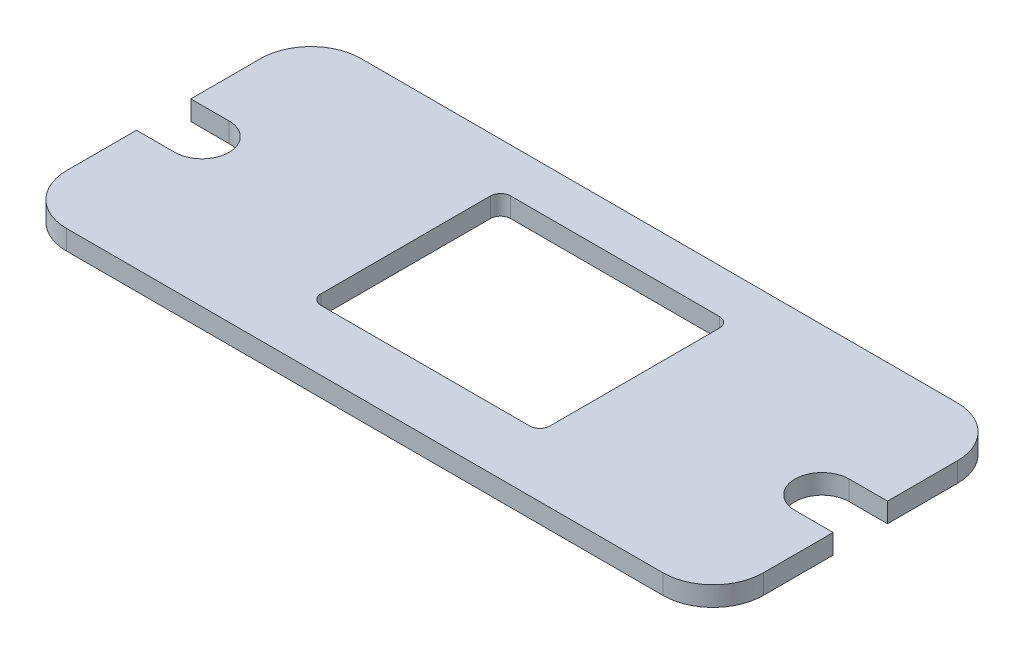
from build123d import *

# Parameters (mm, degrees)
SKETCH1_W           = 54.102
SKETCH1_H           = 22.86
BOSS_EXTRUDE1_DEPTH = 1.524
CUT_EXTRUDE1_DEPTH  = 30.406191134
FILLET1_R           = 3.8989
FILLET2_R           = 3.8989
FILLET3_R           = 3.8989
SKETCH7_W           = 17.78
SKETCH7_H           = 14.732
CUT_EXTRUDE2_DEPTH  = 30.406191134
FILLET4_R           = 0.7874


with BuildPart() as part:
    # Sketch1 → Boss-Extrude1 (new body)
    with BuildSketch(Plane(origin=(0, 0, 0), x_dir=(1, 0, 0), z_dir=(0, 1, 0))):
        Rectangle(SKETCH1_W, SKETCH1_H)
    extrude(amount=BOSS_EXTRUDE1_DEPTH)

    # Sketch2 → Cut-Extrude1 (cut, through all)
    with BuildSketch(Plane(origin=(0, 1.524, 0), x_dir=(1, 0, 0), z_dir=(0, 1, 0))):
        with BuildLine():
            Line((-24.0792, 2.1082), (-27.051, 2.1082))
            Line((-27.051, 2.1082), (-27.051, -2.1082))
            Line((-27.051, -2.1082), (-24.0792, -2.1082))
            ThreePointArc((-24.0792, -2.1082), (-21.971, 0), (-24.0792, 2.1082))
        make_face()
        with BuildLine():
            Line((24.0792, 2.1082), (27.051, 2.1082))
            Line((27.051, 2.1082), (27.051, -2.1082))
            Line((27.051, -2.1082), (24.0792, -2.1082))
            ThreePointArc((24.0792, -2.1082), (21.971, 0), (24.0792, 2.1082))
        make_face()
    extrude(amount=-CUT_EXTRUDE1_DEPTH, mode=Mode.SUBTRACT)

    # Fillet1
    fillet1_edges = [part.edges().sort_by_distance(p)[0] for p in [
        (-27.051, 0.762, -11.43),
    ]]
    fillet(fillet1_edges, radius=FILLET1_R)

    # Fillet2
    fillet2_edges = [part.edges().sort_by_distance(p)[0] for p in [
        (-27.051, 0.762, 11.43),
    ]]
    fillet(fillet2_edges, radius=FILLET2_R)

    # Fillet3
    fillet3_edges = [part.edges().sort_by_distance(p)[0] for p in [
        (27.051, 0.762, 11.43),
        (27.051, 0.762, -11.43),
    ]]
    fillet(fillet3_edges, radius=FILLET3_R)

    # Sketch7 → Cut-Extrude2 (cut, through all)
    with BuildSketch(Plane(origin=(0, 1.524, 0), x_dir=(1, 0, 0), z_dir=(0, 1, 0))):
        with Locations((0, 0.635)):
            Rectangle(SKETCH7_W, SKETCH7_H)
    extrude(amount=-CUT_EXTRUDE2_DEPTH, mode=Mode.SUBTRACT)

    # Fillet4
    fillet4_edges = [part.edges().sort_by_distance(p)[0] for p in [
        (8.89, 0.762, -8.001),
        (8.89, 0.762, 6.731),
        (-8.89, 0.762, 6.731),
        (-8.89, 0.762, -8.001),
    ]]
    fillet(fillet4_edges, radius=FILLET4_R)


solid = part.part
